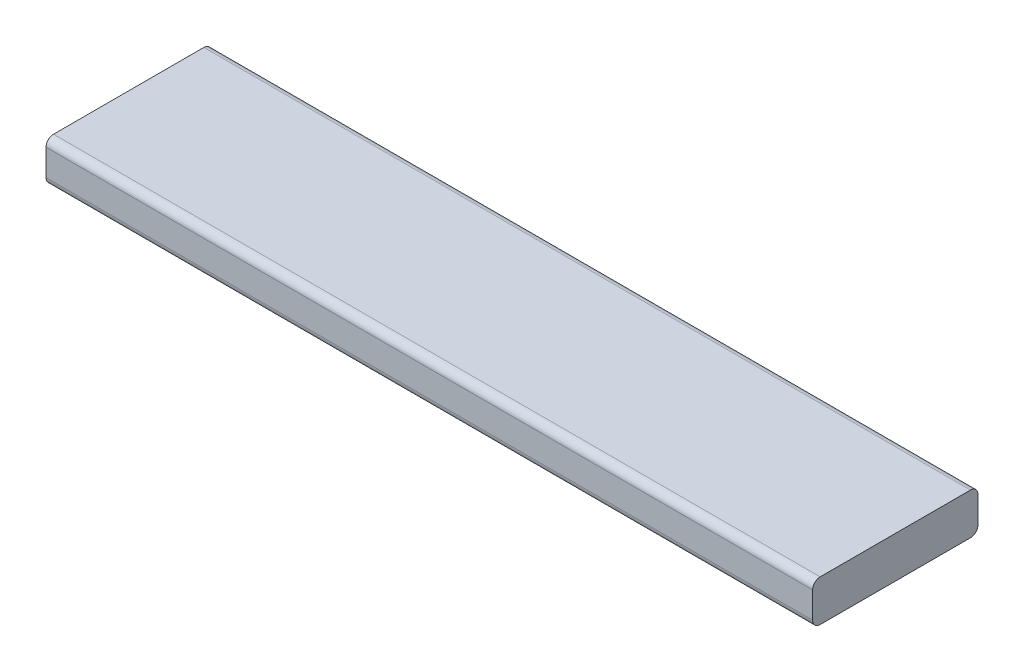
ISO-10303-21;
HEADER;
FILE_DESCRIPTION(('STEP AP214'),'2;1');
FILE_NAME('part.step','',(''),(''),'','','');
FILE_SCHEMA(('AUTOMOTIVE_DESIGN { 1 0 10303 214 1 1 1 1 }'));
ENDSEC;
DATA;
#1=APPLICATION_CONTEXT('core data for automotive mechanical design processes');
#2=APPLICATION_PROTOCOL_DEFINITION('international standard','automotive_design',2000,#1);
#3=PRODUCT_CONTEXT('',#1,'mechanical');
#4=PRODUCT('Part','Part','',(#3));
#5=PRODUCT_RELATED_PRODUCT_CATEGORY('part','',(#4));
#6=PRODUCT_DEFINITION_FORMATION('','',#4);
#7=PRODUCT_DEFINITION_CONTEXT('part definition',#1,'design');
#8=PRODUCT_DEFINITION('design','',#6,#7);
#9=PRODUCT_DEFINITION_SHAPE('','',#8);
#10=(LENGTH_UNIT() NAMED_UNIT(*) SI_UNIT(.MILLI.,.METRE.));
#11=(NAMED_UNIT(*) PLANE_ANGLE_UNIT() SI_UNIT($,.RADIAN.));
#12=(NAMED_UNIT(*) SI_UNIT($,.STERADIAN.) SOLID_ANGLE_UNIT());
#13=UNCERTAINTY_MEASURE_WITH_UNIT(LENGTH_MEASURE(1.E-05),#10,'distance_accuracy_value','');
#14=(GEOMETRIC_REPRESENTATION_CONTEXT(3) GLOBAL_UNCERTAINTY_ASSIGNED_CONTEXT((#13)) GLOBAL_UNIT_ASSIGNED_CONTEXT((#10,
#11,#12)) REPRESENTATION_CONTEXT('',''));
#15=CARTESIAN_POINT('',(0.,0.,0.));
#16=DIRECTION('',(0.,0.,1.));
#17=DIRECTION('',(1.,0.,0.));
#18=AXIS2_PLACEMENT_3D('',#15,#16,#17);
#19=CARTESIAN_POINT('',(791.699463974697,0.,0.));
#20=DIRECTION('',(0.,0.,1.));
#21=DIRECTION('',(1.,0.,0.));
#22=AXIS2_PLACEMENT_3D('',#19,#20,#21);
#23=PLANE('',#22);
#24=DIRECTION('',(0.,1.,0.));
#25=VECTOR('',#24,1.);
#26=CARTESIAN_POINT('',(0.,0.,0.));
#27=LINE('',#26,#25);
#28=CARTESIAN_POINT('',(0.,6.35,0.));
#29=VERTEX_POINT('',#28);
#30=CARTESIAN_POINT('',(0.,28.575,0.));
#31=VERTEX_POINT('',#30);
#32=EDGE_CURVE('E179',#29,#31,#27,.T.);
#33=ORIENTED_EDGE('',*,*,#32,.T.);
#34=DIRECTION('',(-1.,0.,0.));
#35=VECTOR('',#34,1.);
#36=CARTESIAN_POINT('',(791.699463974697,28.575,0.));
#37=LINE('',#36,#35);
#38=CARTESIAN_POINT('',(647.7,28.575,0.));
#39=VERTEX_POINT('',#38);
#40=EDGE_CURVE('E60',#31,#39,#37,.F.);
#41=ORIENTED_EDGE('',*,*,#40,.T.);
#42=DIRECTION('',(0.,1.,0.));
#43=VECTOR('',#42,1.);
#44=CARTESIAN_POINT('',(647.7,0.,0.));
#45=LINE('',#44,#43);
#46=CARTESIAN_POINT('',(647.7,6.35,0.));
#47=VERTEX_POINT('',#46);
#48=EDGE_CURVE('E173',#47,#39,#45,.T.);
#49=ORIENTED_EDGE('',*,*,#48,.F.);
#50=DIRECTION('',(-1.,0.,0.));
#51=VECTOR('',#50,1.);
#52=CARTESIAN_POINT('',(791.699463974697,6.35,0.));
#53=LINE('',#52,#51);
#54=EDGE_CURVE('E121',#47,#29,#53,.T.);
#55=ORIENTED_EDGE('',*,*,#54,.T.);
#56=EDGE_LOOP('',(#33,#41,#49,#55));
#57=FACE_BOUND('',#56,.T.);
#58=ADVANCED_FACE('F45',(#57),#23,.F.);
#59=CARTESIAN_POINT('',(791.699463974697,34.925,0.));
#60=DIRECTION('',(0.,-1.,0.));
#61=DIRECTION('',(0.,0.,-1.));
#62=AXIS2_PLACEMENT_3D('',#59,#60,#61);
#63=PLANE('',#62);
#64=DIRECTION('',(0.,0.,1.));
#65=VECTOR('',#64,1.);
#66=CARTESIAN_POINT('',(0.,34.925,0.));
#67=LINE('',#66,#65);
#68=CARTESIAN_POINT('',(0.,34.925,6.35));
#69=VERTEX_POINT('',#68);
#70=CARTESIAN_POINT('',(0.,34.925,133.35));
#71=VERTEX_POINT('',#70);
#72=EDGE_CURVE('E174',#69,#71,#67,.T.);
#73=ORIENTED_EDGE('',*,*,#72,.T.);
#74=DIRECTION('',(-1.,0.,0.));
#75=VECTOR('',#74,1.);
#76=CARTESIAN_POINT('',(791.699463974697,34.925,133.35));
#77=LINE('',#76,#75);
#78=CARTESIAN_POINT('',(647.7,34.925,133.35));
#79=VERTEX_POINT('',#78);
#80=EDGE_CURVE('E149',#71,#79,#77,.F.);
#81=ORIENTED_EDGE('',*,*,#80,.T.);
#82=DIRECTION('',(0.,0.,1.));
#83=VECTOR('',#82,1.);
#84=CARTESIAN_POINT('',(647.7,34.925,0.));
#85=LINE('',#84,#83);
#86=CARTESIAN_POINT('',(647.7,34.925,6.35));
#87=VERTEX_POINT('',#86);
#88=EDGE_CURVE('E117',#87,#79,#85,.T.);
#89=ORIENTED_EDGE('',*,*,#88,.F.);
#90=DIRECTION('',(-1.,0.,0.));
#91=VECTOR('',#90,1.);
#92=CARTESIAN_POINT('',(791.699463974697,34.925,6.35));
#93=LINE('',#92,#91);
#94=EDGE_CURVE('E146',#87,#69,#93,.T.);
#95=ORIENTED_EDGE('',*,*,#94,.T.);
#96=EDGE_LOOP('',(#73,#81,#89,#95));
#97=FACE_BOUND('',#96,.T.);
#98=ADVANCED_FACE('F189',(#97),#63,.F.);
#99=CARTESIAN_POINT('',(791.699463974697,0.,139.7));
#100=DIRECTION('',(0.,0.,-1.));
#101=DIRECTION('',(-1.,0.,0.));
#102=AXIS2_PLACEMENT_3D('',#99,#100,#101);
#103=PLANE('',#102);
#104=DIRECTION('',(0.,-1.,0.));
#105=VECTOR('',#104,1.);
#106=CARTESIAN_POINT('',(647.7,0.,139.7));
#107=LINE('',#106,#105);
#108=CARTESIAN_POINT('',(647.7,28.575,139.7));
#109=VERTEX_POINT('',#108);
#110=CARTESIAN_POINT('',(647.7,6.34999999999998,139.7));
#111=VERTEX_POINT('',#110);
#112=EDGE_CURVE('E114',#109,#111,#107,.T.);
#113=ORIENTED_EDGE('',*,*,#112,.F.);
#114=DIRECTION('',(-1.,0.,0.));
#115=VECTOR('',#114,1.);
#116=CARTESIAN_POINT('',(791.699463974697,28.575,139.7));
#117=LINE('',#116,#115);
#118=CARTESIAN_POINT('',(0.,28.575,139.7));
#119=VERTEX_POINT('',#118);
#120=EDGE_CURVE('E128',#109,#119,#117,.T.);
#121=ORIENTED_EDGE('',*,*,#120,.T.);
#122=DIRECTION('',(0.,-1.,0.));
#123=VECTOR('',#122,1.);
#124=CARTESIAN_POINT('',(0.,0.,139.7));
#125=LINE('',#124,#123);
#126=CARTESIAN_POINT('',(0.,6.34999999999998,139.7));
#127=VERTEX_POINT('',#126);
#128=EDGE_CURVE('E171',#119,#127,#125,.T.);
#129=ORIENTED_EDGE('',*,*,#128,.T.);
#130=DIRECTION('',(-1.,0.,0.));
#131=VECTOR('',#130,1.);
#132=CARTESIAN_POINT('',(791.699463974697,6.34999999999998,139.7));
#133=LINE('',#132,#131);
#134=EDGE_CURVE('E131',#127,#111,#133,.F.);
#135=ORIENTED_EDGE('',*,*,#134,.T.);
#136=EDGE_LOOP('',(#113,#121,#129,#135));
#137=FACE_BOUND('',#136,.T.);
#138=ADVANCED_FACE('F126',(#137),#103,.F.);
#139=CARTESIAN_POINT('',(791.699463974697,0.,0.));
#140=DIRECTION('',(0.,1.,0.));
#141=DIRECTION('',(0.,0.,1.));
#142=AXIS2_PLACEMENT_3D('',#139,#140,#141);
#143=PLANE('',#142);
#144=DIRECTION('',(0.,0.,-1.));
#145=VECTOR('',#144,1.);
#146=CARTESIAN_POINT('',(0.,0.,0.));
#147=LINE('',#146,#145);
#148=CARTESIAN_POINT('',(0.,0.,133.35));
#149=VERTEX_POINT('',#148);
#150=CARTESIAN_POINT('',(0.,0.,6.35));
#151=VERTEX_POINT('',#150);
#152=EDGE_CURVE('E164',#149,#151,#147,.T.);
#153=ORIENTED_EDGE('',*,*,#152,.T.);
#154=DIRECTION('',(-1.,0.,0.));
#155=VECTOR('',#154,1.);
#156=CARTESIAN_POINT('',(791.699463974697,0.,6.35));
#157=LINE('',#156,#155);
#158=CARTESIAN_POINT('',(647.7,0.,6.35));
#159=VERTEX_POINT('',#158);
#160=EDGE_CURVE('E11',#151,#159,#157,.F.);
#161=ORIENTED_EDGE('',*,*,#160,.T.);
#162=DIRECTION('',(0.,0.,-1.));
#163=VECTOR('',#162,1.);
#164=CARTESIAN_POINT('',(647.7,0.,0.));
#165=LINE('',#164,#163);
#166=CARTESIAN_POINT('',(647.7,0.,133.35));
#167=VERTEX_POINT('',#166);
#168=EDGE_CURVE('E166',#167,#159,#165,.T.);
#169=ORIENTED_EDGE('',*,*,#168,.F.);
#170=DIRECTION('',(-1.,0.,0.));
#171=VECTOR('',#170,1.);
#172=CARTESIAN_POINT('',(791.699463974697,0.,133.35));
#173=LINE('',#172,#171);
#174=EDGE_CURVE('E53',#167,#149,#173,.T.);
#175=ORIENTED_EDGE('',*,*,#174,.T.);
#176=EDGE_LOOP('',(#153,#161,#169,#175));
#177=FACE_BOUND('',#176,.T.);
#178=ADVANCED_FACE('F163',(#177),#143,.F.);
#179=CARTESIAN_POINT('',(0.,0.,0.));
#180=DIRECTION('',(1.,0.,0.));
#181=DIRECTION('',(0.,0.,-1.));
#182=AXIS2_PLACEMENT_3D('',#179,#180,#181);
#183=PLANE('',#182);
#184=ORIENTED_EDGE('',*,*,#128,.F.);
#185=CARTESIAN_POINT('',(0.,28.575,133.35));
#186=DIRECTION('',(1.,0.,0.));
#187=DIRECTION('',(0.,0.,-1.));
#188=AXIS2_PLACEMENT_3D('',#185,#186,#187);
#189=CIRCLE('',#188,6.35);
#190=EDGE_CURVE('E134',#119,#71,#189,.F.);
#191=ORIENTED_EDGE('',*,*,#190,.T.);
#192=ORIENTED_EDGE('',*,*,#72,.F.);
#193=CARTESIAN_POINT('',(0.,28.575,6.35));
#194=DIRECTION('',(1.,0.,0.));
#195=DIRECTION('',(0.,0.,-1.));
#196=AXIS2_PLACEMENT_3D('',#193,#194,#195);
#197=CIRCLE('',#196,6.35);
#198=EDGE_CURVE('E143',#69,#31,#197,.F.);
#199=ORIENTED_EDGE('',*,*,#198,.T.);
#200=ORIENTED_EDGE('',*,*,#32,.F.);
#201=CARTESIAN_POINT('',(0.,6.35,6.35));
#202=DIRECTION('',(1.,0.,0.));
#203=DIRECTION('',(0.,0.,-1.));
#204=AXIS2_PLACEMENT_3D('',#201,#202,#203);
#205=CIRCLE('',#204,6.35);
#206=EDGE_CURVE('E137',#29,#151,#205,.F.);
#207=ORIENTED_EDGE('',*,*,#206,.T.);
#208=ORIENTED_EDGE('',*,*,#152,.F.);
#209=CARTESIAN_POINT('',(0.,6.34999999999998,133.35));
#210=DIRECTION('',(1.,0.,0.));
#211=DIRECTION('',(0.,0.,-1.));
#212=AXIS2_PLACEMENT_3D('',#209,#210,#211);
#213=CIRCLE('',#212,6.35);
#214=EDGE_CURVE('E135',#149,#127,#213,.F.);
#215=ORIENTED_EDGE('',*,*,#214,.T.);
#216=EDGE_LOOP('',(#184,#191,#192,#199,#200,#207,#208,#215));
#217=FACE_BOUND('',#216,.T.);
#218=ADVANCED_FACE('F169',(#217),#183,.F.);
#219=CARTESIAN_POINT('',(647.7,0.,0.));
#220=DIRECTION('',(1.,0.,0.));
#221=DIRECTION('',(0.,0.,-1.));
#222=AXIS2_PLACEMENT_3D('',#219,#220,#221);
#223=PLANE('',#222);
#224=ORIENTED_EDGE('',*,*,#88,.T.);
#225=CARTESIAN_POINT('',(647.7,28.575,133.35));
#226=DIRECTION('',(1.,0.,0.));
#227=DIRECTION('',(0.,0.,-1.));
#228=AXIS2_PLACEMENT_3D('',#225,#226,#227);
#229=CIRCLE('',#228,6.35);
#230=EDGE_CURVE('E111',#79,#109,#229,.T.);
#231=ORIENTED_EDGE('',*,*,#230,.T.);
#232=ORIENTED_EDGE('',*,*,#112,.T.);
#233=CARTESIAN_POINT('',(647.7,6.34999999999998,133.35));
#234=DIRECTION('',(1.,0.,0.));
#235=DIRECTION('',(0.,0.,-1.));
#236=AXIS2_PLACEMENT_3D('',#233,#234,#235);
#237=CIRCLE('',#236,6.35);
#238=EDGE_CURVE('E151',#111,#167,#237,.T.);
#239=ORIENTED_EDGE('',*,*,#238,.T.);
#240=ORIENTED_EDGE('',*,*,#168,.T.);
#241=CARTESIAN_POINT('',(647.7,6.35,6.35));
#242=DIRECTION('',(1.,0.,0.));
#243=DIRECTION('',(0.,0.,-1.));
#244=AXIS2_PLACEMENT_3D('',#241,#242,#243);
#245=CIRCLE('',#244,6.35);
#246=EDGE_CURVE('E67',#159,#47,#245,.T.);
#247=ORIENTED_EDGE('',*,*,#246,.T.);
#248=ORIENTED_EDGE('',*,*,#48,.T.);
#249=CARTESIAN_POINT('',(647.7,28.575,6.35));
#250=DIRECTION('',(1.,0.,0.));
#251=DIRECTION('',(0.,0.,-1.));
#252=AXIS2_PLACEMENT_3D('',#249,#250,#251);
#253=CIRCLE('',#252,6.35);
#254=EDGE_CURVE('E122',#39,#87,#253,.T.);
#255=ORIENTED_EDGE('',*,*,#254,.T.);
#256=EDGE_LOOP('',(#224,#231,#232,#239,#240,#247,#248,#255));
#257=FACE_BOUND('',#256,.T.);
#258=ADVANCED_FACE('F113',(#257),#223,.T.);
#259=CARTESIAN_POINT('',(791.699463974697,28.575,133.35));
#260=DIRECTION('',(-1.,0.,0.));
#261=DIRECTION('',(0.,0.,1.));
#262=AXIS2_PLACEMENT_3D('',#259,#260,#261);
#263=CYLINDRICAL_SURFACE('',#262,6.35);
#264=ORIENTED_EDGE('',*,*,#230,.F.);
#265=ORIENTED_EDGE('',*,*,#80,.F.);
#266=ORIENTED_EDGE('',*,*,#190,.F.);
#267=ORIENTED_EDGE('',*,*,#120,.F.);
#268=EDGE_LOOP('',(#264,#265,#266,#267));
#269=FACE_BOUND('',#268,.T.);
#270=ADVANCED_FACE('F133',(#269),#263,.T.);
#271=CARTESIAN_POINT('',(791.699463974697,28.575,6.35));
#272=DIRECTION('',(-1.,0.,0.));
#273=DIRECTION('',(0.,0.,1.));
#274=AXIS2_PLACEMENT_3D('',#271,#272,#273);
#275=CYLINDRICAL_SURFACE('',#274,6.35);
#276=ORIENTED_EDGE('',*,*,#254,.F.);
#277=ORIENTED_EDGE('',*,*,#40,.F.);
#278=ORIENTED_EDGE('',*,*,#198,.F.);
#279=ORIENTED_EDGE('',*,*,#94,.F.);
#280=EDGE_LOOP('',(#276,#277,#278,#279));
#281=FACE_BOUND('',#280,.T.);
#282=ADVANCED_FACE('F186',(#281),#275,.T.);
#283=CARTESIAN_POINT('',(791.699463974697,6.35,6.35));
#284=DIRECTION('',(-1.,0.,0.));
#285=DIRECTION('',(0.,0.,1.));
#286=AXIS2_PLACEMENT_3D('',#283,#284,#285);
#287=CYLINDRICAL_SURFACE('',#286,6.35);
#288=ORIENTED_EDGE('',*,*,#246,.F.);
#289=ORIENTED_EDGE('',*,*,#160,.F.);
#290=ORIENTED_EDGE('',*,*,#206,.F.);
#291=ORIENTED_EDGE('',*,*,#54,.F.);
#292=EDGE_LOOP('',(#288,#289,#290,#291));
#293=FACE_BOUND('',#292,.T.);
#294=ADVANCED_FACE('F191',(#293),#287,.T.);
#295=CARTESIAN_POINT('',(791.699463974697,6.34999999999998,133.35));
#296=DIRECTION('',(-1.,0.,0.));
#297=DIRECTION('',(0.,0.,1.));
#298=AXIS2_PLACEMENT_3D('',#295,#296,#297);
#299=CYLINDRICAL_SURFACE('',#298,6.35);
#300=ORIENTED_EDGE('',*,*,#238,.F.);
#301=ORIENTED_EDGE('',*,*,#134,.F.);
#302=ORIENTED_EDGE('',*,*,#214,.F.);
#303=ORIENTED_EDGE('',*,*,#174,.F.);
#304=EDGE_LOOP('',(#300,#301,#302,#303));
#305=FACE_BOUND('',#304,.T.);
#306=ADVANCED_FACE('F47',(#305),#299,.T.);
#307=CLOSED_SHELL('',(#58,#98,#138,#178,#218,#258,#270,#282,#294,#306));
#308=MANIFOLD_SOLID_BREP('B2',#307);
#309=ADVANCED_BREP_SHAPE_REPRESENTATION('',(#18,#308),#14);
#310=SHAPE_DEFINITION_REPRESENTATION(#9,#309);
ENDSEC;
END-ISO-10303-21;
